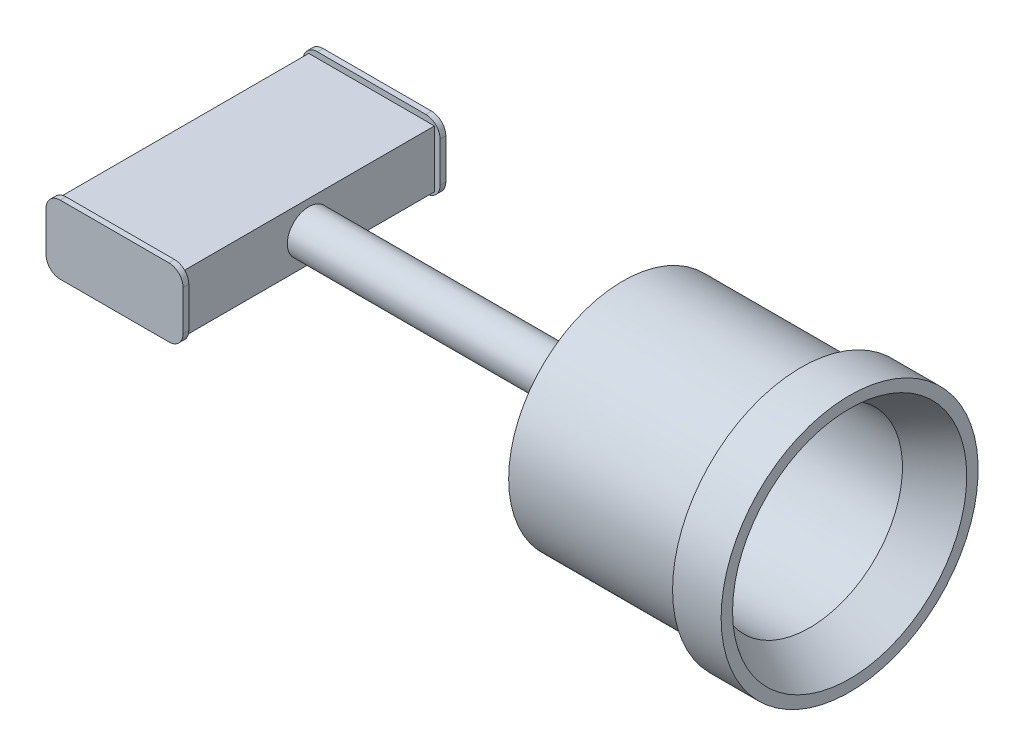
ISO-10303-21;
HEADER;
FILE_DESCRIPTION(('STEP AP214'),'2;1');
FILE_NAME('part.step','',(''),(''),'','','');
FILE_SCHEMA(('AUTOMOTIVE_DESIGN { 1 0 10303 214 1 1 1 1 }'));
ENDSEC;
DATA;
#1=APPLICATION_CONTEXT('core data for automotive mechanical design processes');
#2=APPLICATION_PROTOCOL_DEFINITION('international standard','automotive_design',2000,#1);
#3=PRODUCT_CONTEXT('',#1,'mechanical');
#4=PRODUCT('Part','Part','',(#3));
#5=PRODUCT_RELATED_PRODUCT_CATEGORY('part','',(#4));
#6=PRODUCT_DEFINITION_FORMATION('','',#4);
#7=PRODUCT_DEFINITION_CONTEXT('part definition',#1,'design');
#8=PRODUCT_DEFINITION('design','',#6,#7);
#9=PRODUCT_DEFINITION_SHAPE('','',#8);
#10=(LENGTH_UNIT() NAMED_UNIT(*) SI_UNIT(.MILLI.,.METRE.));
#11=(NAMED_UNIT(*) PLANE_ANGLE_UNIT() SI_UNIT($,.RADIAN.));
#12=(NAMED_UNIT(*) SI_UNIT($,.STERADIAN.) SOLID_ANGLE_UNIT());
#13=UNCERTAINTY_MEASURE_WITH_UNIT(LENGTH_MEASURE(1.E-05),#10,'distance_accuracy_value','');
#14=(GEOMETRIC_REPRESENTATION_CONTEXT(3) GLOBAL_UNCERTAINTY_ASSIGNED_CONTEXT((#13)) GLOBAL_UNIT_ASSIGNED_CONTEXT((#10,
#11,#12)) REPRESENTATION_CONTEXT('',''));
#15=CARTESIAN_POINT('',(0.,0.,0.));
#16=DIRECTION('',(0.,0.,1.));
#17=DIRECTION('',(1.,0.,0.));
#18=AXIS2_PLACEMENT_3D('',#15,#16,#17);
#19=CARTESIAN_POINT('',(37.338,41.275,0.));
#20=DIRECTION('',(-1.,0.,0.));
#21=DIRECTION('',(0.,0.,1.));
#22=AXIS2_PLACEMENT_3D('',#19,#20,#21);
#23=PLANE('',#22);
#24=CARTESIAN_POINT('',(37.338,0.,0.));
#25=DIRECTION('',(-1.,0.,0.));
#26=DIRECTION('',(0.,0.,1.));
#27=AXIS2_PLACEMENT_3D('',#24,#25,#26);
#28=CIRCLE('',#27,41.275);
#29=CARTESIAN_POINT('',(37.338,0.,41.275));
#30=VERTEX_POINT('',#29);
#31=EDGE_CURVE('E11',#30,#30,#28,.T.);
#32=ORIENTED_EDGE('',*,*,#31,.F.);
#33=EDGE_LOOP('',(#32));
#34=FACE_BOUND('',#33,.T.);
#35=ADVANCED_FACE('F26',(#34),#23,.F.);
#36=CARTESIAN_POINT('',(0.,0.,0.));
#37=DIRECTION('',(-1.,0.,0.));
#38=DIRECTION('',(0.,0.,1.));
#39=AXIS2_PLACEMENT_3D('',#36,#37,#38);
#40=CYLINDRICAL_SURFACE('',#39,41.275);
#41=CARTESIAN_POINT('',(102.108,0.,0.));
#42=DIRECTION('',(-1.,0.,0.));
#43=DIRECTION('',(0.,0.,1.));
#44=AXIS2_PLACEMENT_3D('',#41,#42,#43);
#45=CIRCLE('',#44,41.275);
#46=CARTESIAN_POINT('',(102.108,0.,41.275));
#47=VERTEX_POINT('',#46);
#48=EDGE_CURVE('E33',#47,#47,#45,.T.);
#49=ORIENTED_EDGE('',*,*,#48,.F.);
#50=EDGE_LOOP('',(#49));
#51=FACE_BOUND('',#50,.T.);
#52=ORIENTED_EDGE('',*,*,#31,.T.);
#53=EDGE_LOOP('',(#52));
#54=FACE_BOUND('',#53,.T.);
#55=ADVANCED_FACE('F352',(#51,#54),#40,.F.);
#56=CARTESIAN_POINT('',(102.108,0.,0.));
#57=DIRECTION('',(1.,0.,0.));
#58=DIRECTION('',(0.,0.,-1.));
#59=AXIS2_PLACEMENT_3D('',#56,#57,#58);
#60=CONICAL_SURFACE('',#59,41.275,0.545655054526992);
#61=CARTESIAN_POINT('',(119.888,0.,0.));
#62=DIRECTION('',(-1.,0.,0.));
#63=DIRECTION('',(0.,0.,1.));
#64=AXIS2_PLACEMENT_3D('',#61,#62,#63);
#65=CIRCLE('',#64,52.07);
#66=CARTESIAN_POINT('',(119.888,0.,52.07));
#67=VERTEX_POINT('',#66);
#68=EDGE_CURVE('E345',#67,#67,#65,.T.);
#69=ORIENTED_EDGE('',*,*,#68,.F.);
#70=EDGE_LOOP('',(#69));
#71=FACE_BOUND('',#70,.T.);
#72=ORIENTED_EDGE('',*,*,#48,.T.);
#73=EDGE_LOOP('',(#72));
#74=FACE_BOUND('',#73,.T.);
#75=ADVANCED_FACE('F350',(#71,#74),#60,.F.);
#76=CARTESIAN_POINT('',(119.888,57.15,0.));
#77=DIRECTION('',(-1.,0.,0.));
#78=DIRECTION('',(0.,0.,1.));
#79=AXIS2_PLACEMENT_3D('',#76,#77,#78);
#80=PLANE('',#79);
#81=CARTESIAN_POINT('',(119.888,0.,0.));
#82=DIRECTION('',(-1.,0.,0.));
#83=DIRECTION('',(0.,0.,1.));
#84=AXIS2_PLACEMENT_3D('',#81,#82,#83);
#85=CIRCLE('',#84,57.15);
#86=CARTESIAN_POINT('',(119.888,0.,57.15));
#87=VERTEX_POINT('',#86);
#88=EDGE_CURVE('E342',#87,#87,#85,.T.);
#89=ORIENTED_EDGE('',*,*,#88,.F.);
#90=EDGE_LOOP('',(#89));
#91=FACE_BOUND('',#90,.T.);
#92=ORIENTED_EDGE('',*,*,#68,.T.);
#93=EDGE_LOOP('',(#92));
#94=FACE_BOUND('',#93,.T.);
#95=ADVANCED_FACE('F370',(#91,#94),#80,.F.);
#96=CARTESIAN_POINT('',(0.,0.,0.));
#97=DIRECTION('',(-1.,0.,0.));
#98=DIRECTION('',(0.,0.,1.));
#99=AXIS2_PLACEMENT_3D('',#96,#97,#98);
#100=CYLINDRICAL_SURFACE('',#99,57.15);
#101=CARTESIAN_POINT('',(98.298,0.,0.));
#102=DIRECTION('',(-1.,0.,0.));
#103=DIRECTION('',(0.,0.,1.));
#104=AXIS2_PLACEMENT_3D('',#101,#102,#103);
#105=CIRCLE('',#104,57.15);
#106=CARTESIAN_POINT('',(98.298,0.,57.15));
#107=VERTEX_POINT('',#106);
#108=EDGE_CURVE('E339',#107,#107,#105,.T.);
#109=ORIENTED_EDGE('',*,*,#108,.F.);
#110=EDGE_LOOP('',(#109));
#111=FACE_BOUND('',#110,.T.);
#112=ORIENTED_EDGE('',*,*,#88,.T.);
#113=EDGE_LOOP('',(#112));
#114=FACE_BOUND('',#113,.T.);
#115=ADVANCED_FACE('F378',(#111,#114),#100,.T.);
#116=CARTESIAN_POINT('',(98.298,50.8,0.));
#117=DIRECTION('',(1.,0.,0.));
#118=DIRECTION('',(0.,0.,-1.));
#119=AXIS2_PLACEMENT_3D('',#116,#117,#118);
#120=PLANE('',#119);
#121=CARTESIAN_POINT('',(98.298,0.,0.));
#122=DIRECTION('',(-1.,0.,0.));
#123=DIRECTION('',(0.,0.,1.));
#124=AXIS2_PLACEMENT_3D('',#121,#122,#123);
#125=CIRCLE('',#124,50.8);
#126=CARTESIAN_POINT('',(98.298,0.,50.8));
#127=VERTEX_POINT('',#126);
#128=EDGE_CURVE('E336',#127,#127,#125,.T.);
#129=ORIENTED_EDGE('',*,*,#128,.F.);
#130=EDGE_LOOP('',(#129));
#131=FACE_BOUND('',#130,.T.);
#132=ORIENTED_EDGE('',*,*,#108,.T.);
#133=EDGE_LOOP('',(#132));
#134=FACE_BOUND('',#133,.T.);
#135=ADVANCED_FACE('F386',(#131,#134),#120,.F.);
#136=CARTESIAN_POINT('',(0.,0.,0.));
#137=DIRECTION('',(-1.,0.,0.));
#138=DIRECTION('',(0.,0.,1.));
#139=AXIS2_PLACEMENT_3D('',#136,#137,#138);
#140=CYLINDRICAL_SURFACE('',#139,50.8);
#141=CARTESIAN_POINT('',(19.05,0.,0.));
#142=DIRECTION('',(-1.,0.,0.));
#143=DIRECTION('',(0.,0.,1.));
#144=AXIS2_PLACEMENT_3D('',#141,#142,#143);
#145=CIRCLE('',#144,50.8);
#146=CARTESIAN_POINT('',(19.05,0.,50.8));
#147=VERTEX_POINT('',#146);
#148=EDGE_CURVE('E333',#147,#147,#145,.T.);
#149=ORIENTED_EDGE('',*,*,#148,.F.);
#150=EDGE_LOOP('',(#149));
#151=FACE_BOUND('',#150,.T.);
#152=ORIENTED_EDGE('',*,*,#128,.T.);
#153=EDGE_LOOP('',(#152));
#154=FACE_BOUND('',#153,.T.);
#155=ADVANCED_FACE('F394',(#151,#154),#140,.T.);
#156=CARTESIAN_POINT('',(19.05,22.225,0.));
#157=DIRECTION('',(1.,0.,0.));
#158=DIRECTION('',(0.,0.,-1.));
#159=AXIS2_PLACEMENT_3D('',#156,#157,#158);
#160=PLANE('',#159);
#161=CARTESIAN_POINT('',(19.05,0.,0.));
#162=DIRECTION('',(-1.,0.,0.));
#163=DIRECTION('',(0.,0.,1.));
#164=AXIS2_PLACEMENT_3D('',#161,#162,#163);
#165=CIRCLE('',#164,22.225);
#166=CARTESIAN_POINT('',(19.05,0.,22.225));
#167=VERTEX_POINT('',#166);
#168=EDGE_CURVE('E330',#167,#167,#165,.T.);
#169=ORIENTED_EDGE('',*,*,#168,.F.);
#170=EDGE_LOOP('',(#169));
#171=FACE_BOUND('',#170,.T.);
#172=ORIENTED_EDGE('',*,*,#148,.T.);
#173=EDGE_LOOP('',(#172));
#174=FACE_BOUND('',#173,.T.);
#175=ADVANCED_FACE('F402',(#171,#174),#160,.F.);
#176=CARTESIAN_POINT('',(19.05,0.,0.));
#177=DIRECTION('',(1.,0.,0.));
#178=DIRECTION('',(0.,0.,-1.));
#179=AXIS2_PLACEMENT_3D('',#176,#177,#178);
#180=CONICAL_SURFACE('',#179,22.225,0.463647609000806);
#181=CARTESIAN_POINT('',(0.,0.,0.));
#182=DIRECTION('',(-1.,0.,0.));
#183=DIRECTION('',(0.,0.,1.));
#184=AXIS2_PLACEMENT_3D('',#181,#182,#183);
#185=CIRCLE('',#184,12.7);
#186=CARTESIAN_POINT('',(0.,0.,12.7));
#187=VERTEX_POINT('',#186);
#188=EDGE_CURVE('E327',#187,#187,#185,.T.);
#189=ORIENTED_EDGE('',*,*,#188,.F.);
#190=EDGE_LOOP('',(#189));
#191=FACE_BOUND('',#190,.T.);
#192=ORIENTED_EDGE('',*,*,#168,.T.);
#193=EDGE_LOOP('',(#192));
#194=FACE_BOUND('',#193,.T.);
#195=ADVANCED_FACE('F410',(#191,#194),#180,.T.);
#196=CARTESIAN_POINT('',(0.,9.525,0.));
#197=DIRECTION('',(1.,0.,0.));
#198=DIRECTION('',(0.,0.,-1.));
#199=AXIS2_PLACEMENT_3D('',#196,#197,#198);
#200=PLANE('',#199);
#201=CARTESIAN_POINT('',(0.,0.,0.));
#202=DIRECTION('',(-1.,0.,0.));
#203=DIRECTION('',(0.,0.,1.));
#204=AXIS2_PLACEMENT_3D('',#201,#202,#203);
#205=CIRCLE('',#204,9.525);
#206=CARTESIAN_POINT('',(0.,0.,9.525));
#207=VERTEX_POINT('',#206);
#208=EDGE_CURVE('E324',#207,#207,#205,.T.);
#209=ORIENTED_EDGE('',*,*,#208,.F.);
#210=EDGE_LOOP('',(#209));
#211=FACE_BOUND('',#210,.T.);
#212=ORIENTED_EDGE('',*,*,#188,.T.);
#213=EDGE_LOOP('',(#212));
#214=FACE_BOUND('',#213,.T.);
#215=ADVANCED_FACE('F418',(#211,#214),#200,.F.);
#216=CARTESIAN_POINT('',(0.,0.,0.));
#217=DIRECTION('',(-1.,0.,0.));
#218=DIRECTION('',(0.,0.,1.));
#219=AXIS2_PLACEMENT_3D('',#216,#217,#218);
#220=CYLINDRICAL_SURFACE('',#219,9.52499999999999);
#221=CARTESIAN_POINT('',(-120.65,0.,0.));
#222=DIRECTION('',(-1.,0.,0.));
#223=DIRECTION('',(0.,0.,1.));
#224=AXIS2_PLACEMENT_3D('',#221,#222,#223);
#225=CIRCLE('',#224,9.52499999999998);
#226=CARTESIAN_POINT('',(-120.65,0.,9.52499999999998));
#227=VERTEX_POINT('',#226);
#228=EDGE_CURVE('E321',#227,#227,#225,.T.);
#229=ORIENTED_EDGE('',*,*,#228,.F.);
#230=EDGE_LOOP('',(#229));
#231=FACE_BOUND('',#230,.T.);
#232=ORIENTED_EDGE('',*,*,#208,.T.);
#233=EDGE_LOOP('',(#232));
#234=FACE_BOUND('',#233,.T.);
#235=ADVANCED_FACE('F426',(#231,#234),#220,.T.);
#236=CARTESIAN_POINT('',(-120.65,-12.7,-55.88));
#237=DIRECTION('',(-1.,0.,0.));
#238=DIRECTION('',(0.,0.,1.));
#239=AXIS2_PLACEMENT_3D('',#236,#237,#238);
#240=PLANE('',#239);
#241=DIRECTION('',(0.,-1.,0.));
#242=VECTOR('',#241,1.);
#243=CARTESIAN_POINT('',(-120.65,12.7,-55.88));
#244=LINE('',#243,#242);
#245=CARTESIAN_POINT('',(-120.65,12.7,-55.88));
#246=VERTEX_POINT('',#245);
#247=CARTESIAN_POINT('',(-120.65,-12.7,-55.88));
#248=VERTEX_POINT('',#247);
#249=EDGE_CURVE('E294',#246,#248,#244,.T.);
#250=ORIENTED_EDGE('',*,*,#249,.F.);
#251=DIRECTION('',(0.,0.,-1.));
#252=VECTOR('',#251,1.);
#253=CARTESIAN_POINT('',(-120.65,12.7,-55.88));
#254=LINE('',#253,#252);
#255=CARTESIAN_POINT('',(-120.65,12.7,55.88));
#256=VERTEX_POINT('',#255);
#257=EDGE_CURVE('E301',#256,#246,#254,.T.);
#258=ORIENTED_EDGE('',*,*,#257,.F.);
#259=DIRECTION('',(0.,1.,0.));
#260=VECTOR('',#259,1.);
#261=CARTESIAN_POINT('',(-120.65,12.7,55.88));
#262=LINE('',#261,#260);
#263=CARTESIAN_POINT('',(-120.65,-12.7,55.88));
#264=VERTEX_POINT('',#263);
#265=EDGE_CURVE('E299',#264,#256,#262,.T.);
#266=ORIENTED_EDGE('',*,*,#265,.F.);
#267=DIRECTION('',(0.,0.,1.));
#268=VECTOR('',#267,1.);
#269=CARTESIAN_POINT('',(-120.65,-12.7,-55.88));
#270=LINE('',#269,#268);
#271=EDGE_CURVE('E296',#248,#264,#270,.T.);
#272=ORIENTED_EDGE('',*,*,#271,.F.);
#273=EDGE_LOOP('',(#250,#258,#266,#272));
#274=FACE_BOUND('',#273,.T.);
#275=ORIENTED_EDGE('',*,*,#228,.T.);
#276=EDGE_LOOP('',(#275));
#277=FACE_BOUND('',#276,.T.);
#278=ADVANCED_FACE('F434',(#274,#277),#240,.F.);
#279=CARTESIAN_POINT('',(-176.53,-12.7,-55.88));
#280=DIRECTION('',(0.,1.,0.));
#281=DIRECTION('',(0.,0.,1.));
#282=AXIS2_PLACEMENT_3D('',#279,#280,#281);
#283=PLANE('',#282);
#284=ORIENTED_EDGE('',*,*,#271,.T.);
#285=DIRECTION('',(1.,0.,0.));
#286=VECTOR('',#285,1.);
#287=CARTESIAN_POINT('',(-176.53,-12.7,55.88));
#288=LINE('',#287,#286);
#289=CARTESIAN_POINT('',(-176.53,-12.7,55.88));
#290=VERTEX_POINT('',#289);
#291=EDGE_CURVE('E318',#290,#264,#288,.T.);
#292=ORIENTED_EDGE('',*,*,#291,.F.);
#293=DIRECTION('',(0.,0.,1.));
#294=VECTOR('',#293,1.);
#295=CARTESIAN_POINT('',(-176.53,-12.7,-55.88));
#296=LINE('',#295,#294);
#297=CARTESIAN_POINT('',(-176.53,-12.7,-55.88));
#298=VERTEX_POINT('',#297);
#299=EDGE_CURVE('E307',#298,#290,#296,.T.);
#300=ORIENTED_EDGE('',*,*,#299,.F.);
#301=DIRECTION('',(1.,0.,0.));
#302=VECTOR('',#301,1.);
#303=CARTESIAN_POINT('',(-176.53,-12.7,-55.88));
#304=LINE('',#303,#302);
#305=EDGE_CURVE('E48',#298,#248,#304,.T.);
#306=ORIENTED_EDGE('',*,*,#305,.T.);
#307=EDGE_LOOP('',(#284,#292,#300,#306));
#308=FACE_BOUND('',#307,.T.);
#309=ADVANCED_FACE('F525',(#308),#283,.F.);
#310=CARTESIAN_POINT('',(-176.53,12.7,-55.88));
#311=DIRECTION('',(0.,-1.,0.));
#312=DIRECTION('',(0.,0.,-1.));
#313=AXIS2_PLACEMENT_3D('',#310,#311,#312);
#314=PLANE('',#313);
#315=ORIENTED_EDGE('',*,*,#257,.T.);
#316=DIRECTION('',(1.,0.,0.));
#317=VECTOR('',#316,1.);
#318=CARTESIAN_POINT('',(-176.53,12.7,-55.88));
#319=LINE('',#318,#317);
#320=CARTESIAN_POINT('',(-176.53,12.7,-55.88));
#321=VERTEX_POINT('',#320);
#322=EDGE_CURVE('E315',#321,#246,#319,.T.);
#323=ORIENTED_EDGE('',*,*,#322,.F.);
#324=DIRECTION('',(0.,0.,-1.));
#325=VECTOR('',#324,1.);
#326=CARTESIAN_POINT('',(-176.53,12.7,-55.88));
#327=LINE('',#326,#325);
#328=CARTESIAN_POINT('',(-176.53,12.7,55.88));
#329=VERTEX_POINT('',#328);
#330=EDGE_CURVE('E312',#329,#321,#327,.T.);
#331=ORIENTED_EDGE('',*,*,#330,.F.);
#332=DIRECTION('',(1.,0.,0.));
#333=VECTOR('',#332,1.);
#334=CARTESIAN_POINT('',(-176.53,12.7,55.88));
#335=LINE('',#334,#333);
#336=EDGE_CURVE('E40',#329,#256,#335,.T.);
#337=ORIENTED_EDGE('',*,*,#336,.T.);
#338=EDGE_LOOP('',(#315,#323,#331,#337));
#339=FACE_BOUND('',#338,.T.);
#340=ADVANCED_FACE('F533',(#339),#314,.F.);
#341=CARTESIAN_POINT('',(-176.53,-12.7,-55.88));
#342=DIRECTION('',(-1.,0.,0.));
#343=DIRECTION('',(0.,0.,1.));
#344=AXIS2_PLACEMENT_3D('',#341,#342,#343);
#345=PLANE('',#344);
#346=DIRECTION('',(0.,-1.,0.));
#347=VECTOR('',#346,1.);
#348=CARTESIAN_POINT('',(-176.53,12.7,-55.88));
#349=LINE('',#348,#347);
#350=EDGE_CURVE('E304',#321,#298,#349,.T.);
#351=ORIENTED_EDGE('',*,*,#350,.T.);
#352=ORIENTED_EDGE('',*,*,#299,.T.);
#353=DIRECTION('',(0.,1.,0.));
#354=VECTOR('',#353,1.);
#355=CARTESIAN_POINT('',(-176.53,12.7,55.88));
#356=LINE('',#355,#354);
#357=EDGE_CURVE('E310',#290,#329,#356,.T.);
#358=ORIENTED_EDGE('',*,*,#357,.T.);
#359=ORIENTED_EDGE('',*,*,#330,.T.);
#360=EDGE_LOOP('',(#351,#352,#358,#359));
#361=FACE_BOUND('',#360,.T.);
#362=ADVANCED_FACE('F445',(#361),#345,.T.);
#363=CARTESIAN_POINT('',(-172.72,8.89000000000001,-55.88));
#364=DIRECTION('',(0.,0.,1.));
#365=DIRECTION('',(1.,0.,0.));
#366=AXIS2_PLACEMENT_3D('',#363,#364,#365);
#367=PLANE('',#366);
#368=CARTESIAN_POINT('',(-172.72,8.89000000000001,-55.88));
#369=DIRECTION('',(0.,0.,-1.));
#370=DIRECTION('',(1.,0.,0.));
#371=AXIS2_PLACEMENT_3D('',#368,#369,#370);
#372=CIRCLE('',#371,6.35);
#373=CARTESIAN_POINT('',(-179.07,8.89000000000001,-55.88));
#374=VERTEX_POINT('',#373);
#375=CARTESIAN_POINT('',(-172.72,15.24,-55.88));
#376=VERTEX_POINT('',#375);
#377=EDGE_CURVE('E173',#374,#376,#372,.T.);
#378=ORIENTED_EDGE('',*,*,#377,.F.);
#379=DIRECTION('',(0.,1.,0.));
#380=VECTOR('',#379,1.);
#381=CARTESIAN_POINT('',(-179.07,8.89000000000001,-55.88));
#382=LINE('',#381,#380);
#383=CARTESIAN_POINT('',(-179.07,-8.89,-55.88));
#384=VERTEX_POINT('',#383);
#385=EDGE_CURVE('E251',#384,#374,#382,.T.);
#386=ORIENTED_EDGE('',*,*,#385,.F.);
#387=CARTESIAN_POINT('',(-172.72,-8.89,-55.88));
#388=DIRECTION('',(0.,0.,-1.));
#389=DIRECTION('',(-1.,0.,0.));
#390=AXIS2_PLACEMENT_3D('',#387,#388,#389);
#391=CIRCLE('',#390,6.35);
#392=CARTESIAN_POINT('',(-172.72,-15.24,-55.88));
#393=VERTEX_POINT('',#392);
#394=EDGE_CURVE('E249',#393,#384,#391,.T.);
#395=ORIENTED_EDGE('',*,*,#394,.F.);
#396=DIRECTION('',(-1.,0.,0.));
#397=VECTOR('',#396,1.);
#398=CARTESIAN_POINT('',(-124.46,-15.24,-55.88));
#399=LINE('',#398,#397);
#400=CARTESIAN_POINT('',(-124.46,-15.24,-55.88));
#401=VERTEX_POINT('',#400);
#402=EDGE_CURVE('E247',#401,#393,#399,.T.);
#403=ORIENTED_EDGE('',*,*,#402,.F.);
#404=CARTESIAN_POINT('',(-124.46,-8.89,-55.88));
#405=DIRECTION('',(0.,0.,-1.));
#406=DIRECTION('',(-1.,0.,0.));
#407=AXIS2_PLACEMENT_3D('',#404,#405,#406);
#408=CIRCLE('',#407,6.35);
#409=CARTESIAN_POINT('',(-118.11,-8.89,-55.88));
#410=VERTEX_POINT('',#409);
#411=EDGE_CURVE('E245',#410,#401,#408,.T.);
#412=ORIENTED_EDGE('',*,*,#411,.F.);
#413=DIRECTION('',(0.,-1.,0.));
#414=VECTOR('',#413,1.);
#415=CARTESIAN_POINT('',(-118.11,8.89000000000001,-55.88));
#416=LINE('',#415,#414);
#417=CARTESIAN_POINT('',(-118.11,8.89000000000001,-55.88));
#418=VERTEX_POINT('',#417);
#419=EDGE_CURVE('E243',#418,#410,#416,.T.);
#420=ORIENTED_EDGE('',*,*,#419,.F.);
#421=CARTESIAN_POINT('',(-124.46,8.89000000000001,-55.88));
#422=DIRECTION('',(0.,0.,-1.));
#423=DIRECTION('',(-1.,0.,0.));
#424=AXIS2_PLACEMENT_3D('',#421,#422,#423);
#425=CIRCLE('',#424,6.35);
#426=CARTESIAN_POINT('',(-124.46,15.24,-55.88));
#427=VERTEX_POINT('',#426);
#428=EDGE_CURVE('E241',#427,#418,#425,.T.);
#429=ORIENTED_EDGE('',*,*,#428,.F.);
#430=DIRECTION('',(1.,0.,0.));
#431=VECTOR('',#430,1.);
#432=CARTESIAN_POINT('',(-124.46,15.24,-55.88));
#433=LINE('',#432,#431);
#434=EDGE_CURVE('E239',#376,#427,#433,.T.);
#435=ORIENTED_EDGE('',*,*,#434,.F.);
#436=EDGE_LOOP('',(#378,#386,#395,#403,#412,#420,#429,#435));
#437=FACE_BOUND('',#436,.T.);
#438=ORIENTED_EDGE('',*,*,#249,.T.);
#439=ORIENTED_EDGE('',*,*,#305,.F.);
#440=ORIENTED_EDGE('',*,*,#350,.F.);
#441=ORIENTED_EDGE('',*,*,#322,.T.);
#442=EDGE_LOOP('',(#438,#439,#440,#441));
#443=FACE_BOUND('',#442,.T.);
#444=ADVANCED_FACE('F440',(#437,#443),#367,.T.);
#445=CARTESIAN_POINT('',(-172.72,8.89000000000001,-58.42));
#446=DIRECTION('',(0.,0.,1.));
#447=DIRECTION('',(1.,0.,0.));
#448=AXIS2_PLACEMENT_3D('',#445,#446,#447);
#449=CYLINDRICAL_SURFACE('',#448,6.35);
#450=ORIENTED_EDGE('',*,*,#377,.T.);
#451=DIRECTION('',(0.,0.,1.));
#452=VECTOR('',#451,1.);
#453=CARTESIAN_POINT('',(-172.72,15.24,-58.42));
#454=LINE('',#453,#452);
#455=CARTESIAN_POINT('',(-172.72,15.24,-58.42));
#456=VERTEX_POINT('',#455);
#457=EDGE_CURVE('E291',#456,#376,#454,.T.);
#458=ORIENTED_EDGE('',*,*,#457,.F.);
#459=CARTESIAN_POINT('',(-172.72,8.89000000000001,-58.42));
#460=DIRECTION('',(0.,0.,-1.));
#461=DIRECTION('',(1.,0.,0.));
#462=AXIS2_PLACEMENT_3D('',#459,#460,#461);
#463=CIRCLE('',#462,6.35);
#464=CARTESIAN_POINT('',(-179.07,8.89000000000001,-58.42));
#465=VERTEX_POINT('',#464);
#466=EDGE_CURVE('E253',#465,#456,#463,.T.);
#467=ORIENTED_EDGE('',*,*,#466,.F.);
#468=DIRECTION('',(0.,0.,1.));
#469=VECTOR('',#468,1.);
#470=CARTESIAN_POINT('',(-179.07,8.89000000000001,-58.42));
#471=LINE('',#470,#469);
#472=EDGE_CURVE('E270',#465,#374,#471,.T.);
#473=ORIENTED_EDGE('',*,*,#472,.T.);
#474=EDGE_LOOP('',(#450,#458,#467,#473));
#475=FACE_BOUND('',#474,.T.);
#476=ADVANCED_FACE('F444',(#475),#449,.T.);
#477=CARTESIAN_POINT('',(-124.46,15.24,-58.42));
#478=DIRECTION('',(0.,-1.,0.));
#479=DIRECTION('',(0.,0.,-1.));
#480=AXIS2_PLACEMENT_3D('',#477,#478,#479);
#481=PLANE('',#480);
#482=ORIENTED_EDGE('',*,*,#434,.T.);
#483=DIRECTION('',(0.,0.,1.));
#484=VECTOR('',#483,1.);
#485=CARTESIAN_POINT('',(-124.46,15.24,-58.42));
#486=LINE('',#485,#484);
#487=CARTESIAN_POINT('',(-124.46,15.24,-58.42));
#488=VERTEX_POINT('',#487);
#489=EDGE_CURVE('E288',#488,#427,#486,.T.);
#490=ORIENTED_EDGE('',*,*,#489,.F.);
#491=DIRECTION('',(1.,0.,0.));
#492=VECTOR('',#491,1.);
#493=CARTESIAN_POINT('',(-124.46,15.24,-58.42));
#494=LINE('',#493,#492);
#495=EDGE_CURVE('E256',#456,#488,#494,.T.);
#496=ORIENTED_EDGE('',*,*,#495,.F.);
#497=ORIENTED_EDGE('',*,*,#457,.T.);
#498=EDGE_LOOP('',(#482,#490,#496,#497));
#499=FACE_BOUND('',#498,.T.);
#500=ADVANCED_FACE('F454',(#499),#481,.F.);
#501=CARTESIAN_POINT('',(-124.46,8.89000000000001,-58.42));
#502=DIRECTION('',(0.,0.,1.));
#503=DIRECTION('',(1.,0.,0.));
#504=AXIS2_PLACEMENT_3D('',#501,#502,#503);
#505=CYLINDRICAL_SURFACE('',#504,6.35);
#506=ORIENTED_EDGE('',*,*,#428,.T.);
#507=DIRECTION('',(0.,0.,1.));
#508=VECTOR('',#507,1.);
#509=CARTESIAN_POINT('',(-118.11,8.89000000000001,-58.42));
#510=LINE('',#509,#508);
#511=CARTESIAN_POINT('',(-118.11,8.89000000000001,-58.42));
#512=VERTEX_POINT('',#511);
#513=EDGE_CURVE('E285',#512,#418,#510,.T.);
#514=ORIENTED_EDGE('',*,*,#513,.F.);
#515=CARTESIAN_POINT('',(-124.46,8.89000000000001,-58.42));
#516=DIRECTION('',(0.,0.,-1.));
#517=DIRECTION('',(-1.,0.,0.));
#518=AXIS2_PLACEMENT_3D('',#515,#516,#517);
#519=CIRCLE('',#518,6.35);
#520=EDGE_CURVE('E258',#488,#512,#519,.T.);
#521=ORIENTED_EDGE('',*,*,#520,.F.);
#522=ORIENTED_EDGE('',*,*,#489,.T.);
#523=EDGE_LOOP('',(#506,#514,#521,#522));
#524=FACE_BOUND('',#523,.T.);
#525=ADVANCED_FACE('F462',(#524),#505,.T.);
#526=CARTESIAN_POINT('',(-118.11,8.89000000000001,-58.42));
#527=DIRECTION('',(-1.,0.,0.));
#528=DIRECTION('',(0.,0.,1.));
#529=AXIS2_PLACEMENT_3D('',#526,#527,#528);
#530=PLANE('',#529);
#531=ORIENTED_EDGE('',*,*,#419,.T.);
#532=DIRECTION('',(0.,0.,1.));
#533=VECTOR('',#532,1.);
#534=CARTESIAN_POINT('',(-118.11,-8.89,-58.42));
#535=LINE('',#534,#533);
#536=CARTESIAN_POINT('',(-118.11,-8.89,-58.42));
#537=VERTEX_POINT('',#536);
#538=EDGE_CURVE('E282',#537,#410,#535,.T.);
#539=ORIENTED_EDGE('',*,*,#538,.F.);
#540=DIRECTION('',(0.,-1.,0.));
#541=VECTOR('',#540,1.);
#542=CARTESIAN_POINT('',(-118.11,8.89000000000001,-58.42));
#543=LINE('',#542,#541);
#544=EDGE_CURVE('E260',#512,#537,#543,.T.);
#545=ORIENTED_EDGE('',*,*,#544,.F.);
#546=ORIENTED_EDGE('',*,*,#513,.T.);
#547=EDGE_LOOP('',(#531,#539,#545,#546));
#548=FACE_BOUND('',#547,.T.);
#549=ADVANCED_FACE('F470',(#548),#530,.F.);
#550=CARTESIAN_POINT('',(-124.46,-8.89,-58.42));
#551=DIRECTION('',(0.,0.,1.));
#552=DIRECTION('',(1.,0.,0.));
#553=AXIS2_PLACEMENT_3D('',#550,#551,#552);
#554=CYLINDRICAL_SURFACE('',#553,6.35);
#555=ORIENTED_EDGE('',*,*,#411,.T.);
#556=DIRECTION('',(0.,0.,1.));
#557=VECTOR('',#556,1.);
#558=CARTESIAN_POINT('',(-124.46,-15.24,-58.42));
#559=LINE('',#558,#557);
#560=CARTESIAN_POINT('',(-124.46,-15.24,-58.42));
#561=VERTEX_POINT('',#560);
#562=EDGE_CURVE('E279',#561,#401,#559,.T.);
#563=ORIENTED_EDGE('',*,*,#562,.F.);
#564=CARTESIAN_POINT('',(-124.46,-8.89,-58.42));
#565=DIRECTION('',(0.,0.,-1.));
#566=DIRECTION('',(-1.,0.,0.));
#567=AXIS2_PLACEMENT_3D('',#564,#565,#566);
#568=CIRCLE('',#567,6.35);
#569=EDGE_CURVE('E262',#537,#561,#568,.T.);
#570=ORIENTED_EDGE('',*,*,#569,.F.);
#571=ORIENTED_EDGE('',*,*,#538,.T.);
#572=EDGE_LOOP('',(#555,#563,#570,#571));
#573=FACE_BOUND('',#572,.T.);
#574=ADVANCED_FACE('F478',(#573),#554,.T.);
#575=CARTESIAN_POINT('',(-124.46,-15.24,-58.42));
#576=DIRECTION('',(0.,1.,0.));
#577=DIRECTION('',(0.,0.,1.));
#578=AXIS2_PLACEMENT_3D('',#575,#576,#577);
#579=PLANE('',#578);
#580=ORIENTED_EDGE('',*,*,#402,.T.);
#581=DIRECTION('',(0.,0.,1.));
#582=VECTOR('',#581,1.);
#583=CARTESIAN_POINT('',(-172.72,-15.24,-58.42));
#584=LINE('',#583,#582);
#585=CARTESIAN_POINT('',(-172.72,-15.24,-58.42));
#586=VERTEX_POINT('',#585);
#587=EDGE_CURVE('E276',#586,#393,#584,.T.);
#588=ORIENTED_EDGE('',*,*,#587,.F.);
#589=DIRECTION('',(-1.,0.,0.));
#590=VECTOR('',#589,1.);
#591=CARTESIAN_POINT('',(-124.46,-15.24,-58.42));
#592=LINE('',#591,#590);
#593=EDGE_CURVE('E264',#561,#586,#592,.T.);
#594=ORIENTED_EDGE('',*,*,#593,.F.);
#595=ORIENTED_EDGE('',*,*,#562,.T.);
#596=EDGE_LOOP('',(#580,#588,#594,#595));
#597=FACE_BOUND('',#596,.T.);
#598=ADVANCED_FACE('F486',(#597),#579,.F.);
#599=CARTESIAN_POINT('',(-172.72,-8.89,-58.42));
#600=DIRECTION('',(0.,0.,1.));
#601=DIRECTION('',(1.,0.,0.));
#602=AXIS2_PLACEMENT_3D('',#599,#600,#601);
#603=CYLINDRICAL_SURFACE('',#602,6.35);
#604=ORIENTED_EDGE('',*,*,#394,.T.);
#605=DIRECTION('',(0.,0.,1.));
#606=VECTOR('',#605,1.);
#607=CARTESIAN_POINT('',(-179.07,-8.89,-58.42));
#608=LINE('',#607,#606);
#609=CARTESIAN_POINT('',(-179.07,-8.89,-58.42));
#610=VERTEX_POINT('',#609);
#611=EDGE_CURVE('E273',#610,#384,#608,.T.);
#612=ORIENTED_EDGE('',*,*,#611,.F.);
#613=CARTESIAN_POINT('',(-172.72,-8.89,-58.42));
#614=DIRECTION('',(0.,0.,-1.));
#615=DIRECTION('',(-1.,0.,0.));
#616=AXIS2_PLACEMENT_3D('',#613,#614,#615);
#617=CIRCLE('',#616,6.35);
#618=EDGE_CURVE('E266',#586,#610,#617,.T.);
#619=ORIENTED_EDGE('',*,*,#618,.F.);
#620=ORIENTED_EDGE('',*,*,#587,.T.);
#621=EDGE_LOOP('',(#604,#612,#619,#620));
#622=FACE_BOUND('',#621,.T.);
#623=ADVANCED_FACE('F494',(#622),#603,.T.);
#624=CARTESIAN_POINT('',(-179.07,8.89000000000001,-58.42));
#625=DIRECTION('',(1.,0.,0.));
#626=DIRECTION('',(0.,0.,-1.));
#627=AXIS2_PLACEMENT_3D('',#624,#625,#626);
#628=PLANE('',#627);
#629=ORIENTED_EDGE('',*,*,#385,.T.);
#630=ORIENTED_EDGE('',*,*,#472,.F.);
#631=DIRECTION('',(0.,1.,0.));
#632=VECTOR('',#631,1.);
#633=CARTESIAN_POINT('',(-179.07,8.89000000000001,-58.42));
#634=LINE('',#633,#632);
#635=EDGE_CURVE('E268',#610,#465,#634,.T.);
#636=ORIENTED_EDGE('',*,*,#635,.F.);
#637=ORIENTED_EDGE('',*,*,#611,.T.);
#638=EDGE_LOOP('',(#629,#630,#636,#637));
#639=FACE_BOUND('',#638,.T.);
#640=ADVANCED_FACE('F502',(#639),#628,.F.);
#641=CARTESIAN_POINT('',(-172.72,8.89000000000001,-58.42));
#642=DIRECTION('',(0.,0.,1.));
#643=DIRECTION('',(1.,0.,0.));
#644=AXIS2_PLACEMENT_3D('',#641,#642,#643);
#645=PLANE('',#644);
#646=ORIENTED_EDGE('',*,*,#466,.T.);
#647=ORIENTED_EDGE('',*,*,#495,.T.);
#648=ORIENTED_EDGE('',*,*,#520,.T.);
#649=ORIENTED_EDGE('',*,*,#544,.T.);
#650=ORIENTED_EDGE('',*,*,#569,.T.);
#651=ORIENTED_EDGE('',*,*,#593,.T.);
#652=ORIENTED_EDGE('',*,*,#618,.T.);
#653=ORIENTED_EDGE('',*,*,#635,.T.);
#654=EDGE_LOOP('',(#646,#647,#648,#649,#650,#651,#652,#653));
#655=FACE_BOUND('',#654,.T.);
#656=ADVANCED_FACE('F510',(#655),#645,.F.);
#657=CARTESIAN_POINT('',(-172.72,8.89000000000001,55.88));
#658=DIRECTION('',(0.,0.,-1.));
#659=DIRECTION('',(1.,0.,0.));
#660=AXIS2_PLACEMENT_3D('',#657,#658,#659);
#661=PLANE('',#660);
#662=CARTESIAN_POINT('',(-172.72,8.89000000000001,55.88));
#663=DIRECTION('',(0.,0.,-1.));
#664=DIRECTION('',(1.,0.,0.));
#665=AXIS2_PLACEMENT_3D('',#662,#663,#664);
#666=CIRCLE('',#665,6.35);
#667=CARTESIAN_POINT('',(-179.07,8.89000000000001,55.88));
#668=VERTEX_POINT('',#667);
#669=CARTESIAN_POINT('',(-172.72,15.24,55.88));
#670=VERTEX_POINT('',#669);
#671=EDGE_CURVE('E177',#668,#670,#666,.T.);
#672=ORIENTED_EDGE('',*,*,#671,.T.);
#673=DIRECTION('',(1.,0.,0.));
#674=VECTOR('',#673,1.);
#675=CARTESIAN_POINT('',(-124.46,15.24,55.88));
#676=LINE('',#675,#674);
#677=CARTESIAN_POINT('',(-124.46,15.24,55.88));
#678=VERTEX_POINT('',#677);
#679=EDGE_CURVE('E202',#670,#678,#676,.T.);
#680=ORIENTED_EDGE('',*,*,#679,.T.);
#681=CARTESIAN_POINT('',(-124.46,8.89000000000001,55.88));
#682=DIRECTION('',(0.,0.,-1.));
#683=DIRECTION('',(-1.,0.,0.));
#684=AXIS2_PLACEMENT_3D('',#681,#682,#683);
#685=CIRCLE('',#684,6.35);
#686=CARTESIAN_POINT('',(-118.11,8.89000000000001,55.88));
#687=VERTEX_POINT('',#686);
#688=EDGE_CURVE('E199',#678,#687,#685,.T.);
#689=ORIENTED_EDGE('',*,*,#688,.T.);
#690=DIRECTION('',(0.,-1.,0.));
#691=VECTOR('',#690,1.);
#692=CARTESIAN_POINT('',(-118.11,8.89000000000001,55.88));
#693=LINE('',#692,#691);
#694=CARTESIAN_POINT('',(-118.11,-8.89,55.88));
#695=VERTEX_POINT('',#694);
#696=EDGE_CURVE('E196',#687,#695,#693,.T.);
#697=ORIENTED_EDGE('',*,*,#696,.T.);
#698=CARTESIAN_POINT('',(-124.46,-8.89,55.88));
#699=DIRECTION('',(0.,0.,-1.));
#700=DIRECTION('',(-1.,0.,0.));
#701=AXIS2_PLACEMENT_3D('',#698,#699,#700);
#702=CIRCLE('',#701,6.35);
#703=CARTESIAN_POINT('',(-124.46,-15.24,55.88));
#704=VERTEX_POINT('',#703);
#705=EDGE_CURVE('E193',#695,#704,#702,.T.);
#706=ORIENTED_EDGE('',*,*,#705,.T.);
#707=DIRECTION('',(-1.,0.,0.));
#708=VECTOR('',#707,1.);
#709=CARTESIAN_POINT('',(-124.46,-15.24,55.88));
#710=LINE('',#709,#708);
#711=CARTESIAN_POINT('',(-172.72,-15.24,55.88));
#712=VERTEX_POINT('',#711);
#713=EDGE_CURVE('E189',#704,#712,#710,.T.);
#714=ORIENTED_EDGE('',*,*,#713,.T.);
#715=CARTESIAN_POINT('',(-172.72,-8.89,55.88));
#716=DIRECTION('',(0.,0.,-1.));
#717=DIRECTION('',(-1.,0.,0.));
#718=AXIS2_PLACEMENT_3D('',#715,#716,#717);
#719=CIRCLE('',#718,6.35);
#720=CARTESIAN_POINT('',(-179.07,-8.89,55.88));
#721=VERTEX_POINT('',#720);
#722=EDGE_CURVE('E187',#712,#721,#719,.T.);
#723=ORIENTED_EDGE('',*,*,#722,.T.);
#724=DIRECTION('',(0.,1.,0.));
#725=VECTOR('',#724,1.);
#726=CARTESIAN_POINT('',(-179.07,8.89000000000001,55.88));
#727=LINE('',#726,#725);
#728=EDGE_CURVE('E166',#721,#668,#727,.T.);
#729=ORIENTED_EDGE('',*,*,#728,.T.);
#730=EDGE_LOOP('',(#672,#680,#689,#697,#706,#714,#723,#729));
#731=FACE_BOUND('',#730,.T.);
#732=ORIENTED_EDGE('',*,*,#265,.T.);
#733=ORIENTED_EDGE('',*,*,#336,.F.);
#734=ORIENTED_EDGE('',*,*,#357,.F.);
#735=ORIENTED_EDGE('',*,*,#291,.T.);
#736=EDGE_LOOP('',(#732,#733,#734,#735));
#737=FACE_BOUND('',#736,.T.);
#738=ADVANCED_FACE('F184',(#731,#737),#661,.T.);
#739=CARTESIAN_POINT('',(-172.72,8.89000000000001,58.42));
#740=DIRECTION('',(0.,0.,-1.));
#741=DIRECTION('',(-1.,0.,0.));
#742=AXIS2_PLACEMENT_3D('',#739,#740,#741);
#743=CYLINDRICAL_SURFACE('',#742,6.35);
#744=ORIENTED_EDGE('',*,*,#671,.F.);
#745=DIRECTION('',(0.,0.,-1.));
#746=VECTOR('',#745,1.);
#747=CARTESIAN_POINT('',(-179.07,8.89000000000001,58.42));
#748=LINE('',#747,#746);
#749=CARTESIAN_POINT('',(-179.07,8.89000000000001,58.42));
#750=VERTEX_POINT('',#749);
#751=EDGE_CURVE('E162',#750,#668,#748,.T.);
#752=ORIENTED_EDGE('',*,*,#751,.F.);
#753=CARTESIAN_POINT('',(-172.72,8.89000000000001,58.42));
#754=DIRECTION('',(0.,0.,-1.));
#755=DIRECTION('',(1.,0.,0.));
#756=AXIS2_PLACEMENT_3D('',#753,#754,#755);
#757=CIRCLE('',#756,6.35);
#758=CARTESIAN_POINT('',(-172.72,15.24,58.42));
#759=VERTEX_POINT('',#758);
#760=EDGE_CURVE('E204',#750,#759,#757,.T.);
#761=ORIENTED_EDGE('',*,*,#760,.T.);
#762=DIRECTION('',(0.,0.,-1.));
#763=VECTOR('',#762,1.);
#764=CARTESIAN_POINT('',(-172.72,15.24,58.42));
#765=LINE('',#764,#763);
#766=EDGE_CURVE('E179',#759,#670,#765,.T.);
#767=ORIENTED_EDGE('',*,*,#766,.T.);
#768=EDGE_LOOP('',(#744,#752,#761,#767));
#769=FACE_BOUND('',#768,.T.);
#770=ADVANCED_FACE('F178',(#769),#743,.T.);
#771=CARTESIAN_POINT('',(-179.07,8.89000000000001,58.42));
#772=DIRECTION('',(-1.,0.,0.));
#773=DIRECTION('',(0.,0.,1.));
#774=AXIS2_PLACEMENT_3D('',#771,#772,#773);
#775=PLANE('',#774);
#776=ORIENTED_EDGE('',*,*,#728,.F.);
#777=DIRECTION('',(0.,0.,-1.));
#778=VECTOR('',#777,1.);
#779=CARTESIAN_POINT('',(-179.07,-8.89,58.42));
#780=LINE('',#779,#778);
#781=CARTESIAN_POINT('',(-179.07,-8.89,58.42));
#782=VERTEX_POINT('',#781);
#783=EDGE_CURVE('E174',#782,#721,#780,.T.);
#784=ORIENTED_EDGE('',*,*,#783,.F.);
#785=DIRECTION('',(0.,1.,0.));
#786=VECTOR('',#785,1.);
#787=CARTESIAN_POINT('',(-179.07,8.89000000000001,58.42));
#788=LINE('',#787,#786);
#789=EDGE_CURVE('E169',#782,#750,#788,.T.);
#790=ORIENTED_EDGE('',*,*,#789,.T.);
#791=ORIENTED_EDGE('',*,*,#751,.T.);
#792=EDGE_LOOP('',(#776,#784,#790,#791));
#793=FACE_BOUND('',#792,.T.);
#794=ADVANCED_FACE('F164',(#793),#775,.T.);
#795=CARTESIAN_POINT('',(-172.72,-8.89,58.42));
#796=DIRECTION('',(0.,0.,-1.));
#797=DIRECTION('',(-1.,0.,0.));
#798=AXIS2_PLACEMENT_3D('',#795,#796,#797);
#799=CYLINDRICAL_SURFACE('',#798,6.35);
#800=ORIENTED_EDGE('',*,*,#722,.F.);
#801=DIRECTION('',(0.,0.,-1.));
#802=VECTOR('',#801,1.);
#803=CARTESIAN_POINT('',(-172.72,-15.24,58.42));
#804=LINE('',#803,#802);
#805=CARTESIAN_POINT('',(-172.72,-15.24,58.42));
#806=VERTEX_POINT('',#805);
#807=EDGE_CURVE('E234',#806,#712,#804,.T.);
#808=ORIENTED_EDGE('',*,*,#807,.F.);
#809=CARTESIAN_POINT('',(-172.72,-8.89,58.42));
#810=DIRECTION('',(0.,0.,-1.));
#811=DIRECTION('',(-1.,0.,0.));
#812=AXIS2_PLACEMENT_3D('',#809,#810,#811);
#813=CIRCLE('',#812,6.35);
#814=EDGE_CURVE('E207',#806,#782,#813,.T.);
#815=ORIENTED_EDGE('',*,*,#814,.T.);
#816=ORIENTED_EDGE('',*,*,#783,.T.);
#817=EDGE_LOOP('',(#800,#808,#815,#816));
#818=FACE_BOUND('',#817,.T.);
#819=ADVANCED_FACE('F565',(#818),#799,.T.);
#820=CARTESIAN_POINT('',(-124.46,-15.24,58.42));
#821=DIRECTION('',(0.,-1.,0.));
#822=DIRECTION('',(0.,0.,-1.));
#823=AXIS2_PLACEMENT_3D('',#820,#821,#822);
#824=PLANE('',#823);
#825=ORIENTED_EDGE('',*,*,#713,.F.);
#826=DIRECTION('',(0.,0.,-1.));
#827=VECTOR('',#826,1.);
#828=CARTESIAN_POINT('',(-124.46,-15.24,58.42));
#829=LINE('',#828,#827);
#830=CARTESIAN_POINT('',(-124.46,-15.24,58.42));
#831=VERTEX_POINT('',#830);
#832=EDGE_CURVE('E232',#831,#704,#829,.T.);
#833=ORIENTED_EDGE('',*,*,#832,.F.);
#834=DIRECTION('',(-1.,0.,0.));
#835=VECTOR('',#834,1.);
#836=CARTESIAN_POINT('',(-124.46,-15.24,58.42));
#837=LINE('',#836,#835);
#838=EDGE_CURVE('E210',#831,#806,#837,.T.);
#839=ORIENTED_EDGE('',*,*,#838,.T.);
#840=ORIENTED_EDGE('',*,*,#807,.T.);
#841=EDGE_LOOP('',(#825,#833,#839,#840));
#842=FACE_BOUND('',#841,.T.);
#843=ADVANCED_FACE('F572',(#842),#824,.T.);
#844=CARTESIAN_POINT('',(-124.46,-8.89,58.42));
#845=DIRECTION('',(0.,0.,-1.));
#846=DIRECTION('',(-1.,0.,0.));
#847=AXIS2_PLACEMENT_3D('',#844,#845,#846);
#848=CYLINDRICAL_SURFACE('',#847,6.35);
#849=ORIENTED_EDGE('',*,*,#705,.F.);
#850=DIRECTION('',(0.,0.,-1.));
#851=VECTOR('',#850,1.);
#852=CARTESIAN_POINT('',(-118.11,-8.89,58.42));
#853=LINE('',#852,#851);
#854=CARTESIAN_POINT('',(-118.11,-8.89,58.42));
#855=VERTEX_POINT('',#854);
#856=EDGE_CURVE('E230',#855,#695,#853,.T.);
#857=ORIENTED_EDGE('',*,*,#856,.F.);
#858=CARTESIAN_POINT('',(-124.46,-8.89,58.42));
#859=DIRECTION('',(0.,0.,-1.));
#860=DIRECTION('',(-1.,0.,0.));
#861=AXIS2_PLACEMENT_3D('',#858,#859,#860);
#862=CIRCLE('',#861,6.35);
#863=EDGE_CURVE('E213',#855,#831,#862,.T.);
#864=ORIENTED_EDGE('',*,*,#863,.T.);
#865=ORIENTED_EDGE('',*,*,#832,.T.);
#866=EDGE_LOOP('',(#849,#857,#864,#865));
#867=FACE_BOUND('',#866,.T.);
#868=ADVANCED_FACE('F580',(#867),#848,.T.);
#869=CARTESIAN_POINT('',(-118.11,8.89000000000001,58.42));
#870=DIRECTION('',(1.,0.,0.));
#871=DIRECTION('',(0.,0.,-1.));
#872=AXIS2_PLACEMENT_3D('',#869,#870,#871);
#873=PLANE('',#872);
#874=ORIENTED_EDGE('',*,*,#696,.F.);
#875=DIRECTION('',(0.,0.,-1.));
#876=VECTOR('',#875,1.);
#877=CARTESIAN_POINT('',(-118.11,8.89000000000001,58.42));
#878=LINE('',#877,#876);
#879=CARTESIAN_POINT('',(-118.11,8.89000000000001,58.42));
#880=VERTEX_POINT('',#879);
#881=EDGE_CURVE('E228',#880,#687,#878,.T.);
#882=ORIENTED_EDGE('',*,*,#881,.F.);
#883=DIRECTION('',(0.,-1.,0.));
#884=VECTOR('',#883,1.);
#885=CARTESIAN_POINT('',(-118.11,8.89000000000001,58.42));
#886=LINE('',#885,#884);
#887=EDGE_CURVE('E216',#880,#855,#886,.T.);
#888=ORIENTED_EDGE('',*,*,#887,.T.);
#889=ORIENTED_EDGE('',*,*,#856,.T.);
#890=EDGE_LOOP('',(#874,#882,#888,#889));
#891=FACE_BOUND('',#890,.T.);
#892=ADVANCED_FACE('F588',(#891),#873,.T.);
#893=CARTESIAN_POINT('',(-124.46,8.89000000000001,58.42));
#894=DIRECTION('',(0.,0.,-1.));
#895=DIRECTION('',(-1.,0.,0.));
#896=AXIS2_PLACEMENT_3D('',#893,#894,#895);
#897=CYLINDRICAL_SURFACE('',#896,6.35);
#898=ORIENTED_EDGE('',*,*,#688,.F.);
#899=DIRECTION('',(0.,0.,-1.));
#900=VECTOR('',#899,1.);
#901=CARTESIAN_POINT('',(-124.46,15.24,58.42));
#902=LINE('',#901,#900);
#903=CARTESIAN_POINT('',(-124.46,15.24,58.42));
#904=VERTEX_POINT('',#903);
#905=EDGE_CURVE('E226',#904,#678,#902,.T.);
#906=ORIENTED_EDGE('',*,*,#905,.F.);
#907=CARTESIAN_POINT('',(-124.46,8.89000000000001,58.42));
#908=DIRECTION('',(0.,0.,-1.));
#909=DIRECTION('',(-1.,0.,0.));
#910=AXIS2_PLACEMENT_3D('',#907,#908,#909);
#911=CIRCLE('',#910,6.35);
#912=EDGE_CURVE('E219',#904,#880,#911,.T.);
#913=ORIENTED_EDGE('',*,*,#912,.T.);
#914=ORIENTED_EDGE('',*,*,#881,.T.);
#915=EDGE_LOOP('',(#898,#906,#913,#914));
#916=FACE_BOUND('',#915,.T.);
#917=ADVANCED_FACE('F596',(#916),#897,.T.);
#918=CARTESIAN_POINT('',(-124.46,15.24,58.42));
#919=DIRECTION('',(0.,1.,0.));
#920=DIRECTION('',(0.,0.,1.));
#921=AXIS2_PLACEMENT_3D('',#918,#919,#920);
#922=PLANE('',#921);
#923=ORIENTED_EDGE('',*,*,#679,.F.);
#924=ORIENTED_EDGE('',*,*,#766,.F.);
#925=DIRECTION('',(1.,0.,0.));
#926=VECTOR('',#925,1.);
#927=CARTESIAN_POINT('',(-124.46,15.24,58.42));
#928=LINE('',#927,#926);
#929=EDGE_CURVE('E222',#759,#904,#928,.T.);
#930=ORIENTED_EDGE('',*,*,#929,.T.);
#931=ORIENTED_EDGE('',*,*,#905,.T.);
#932=EDGE_LOOP('',(#923,#924,#930,#931));
#933=FACE_BOUND('',#932,.T.);
#934=ADVANCED_FACE('F604',(#933),#922,.T.);
#935=CARTESIAN_POINT('',(-172.72,8.89000000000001,58.42));
#936=DIRECTION('',(0.,0.,-1.));
#937=DIRECTION('',(1.,0.,0.));
#938=AXIS2_PLACEMENT_3D('',#935,#936,#937);
#939=PLANE('',#938);
#940=ORIENTED_EDGE('',*,*,#760,.F.);
#941=ORIENTED_EDGE('',*,*,#789,.F.);
#942=ORIENTED_EDGE('',*,*,#814,.F.);
#943=ORIENTED_EDGE('',*,*,#838,.F.);
#944=ORIENTED_EDGE('',*,*,#863,.F.);
#945=ORIENTED_EDGE('',*,*,#887,.F.);
#946=ORIENTED_EDGE('',*,*,#912,.F.);
#947=ORIENTED_EDGE('',*,*,#929,.F.);
#948=EDGE_LOOP('',(#940,#941,#942,#943,#944,#945,#946,#947));
#949=FACE_BOUND('',#948,.T.);
#950=ADVANCED_FACE('F612',(#949),#939,.F.);
#951=CLOSED_SHELL('',(#35,#55,#75,#95,#115,#135,#155,#175,#195,#215,#235,#278,#309,#340,#362,
#444,#476,#500,#525,#549,#574,#598,#623,#640,#656,#738,#770,#794,#819,#843,#868,#892,#917,#934,#950));
#952=MANIFOLD_SOLID_BREP('B2',#951);
#953=ADVANCED_BREP_SHAPE_REPRESENTATION('',(#18,#952),#14);
#954=SHAPE_DEFINITION_REPRESENTATION(#9,#953);
ENDSEC;
END-ISO-10303-21;
